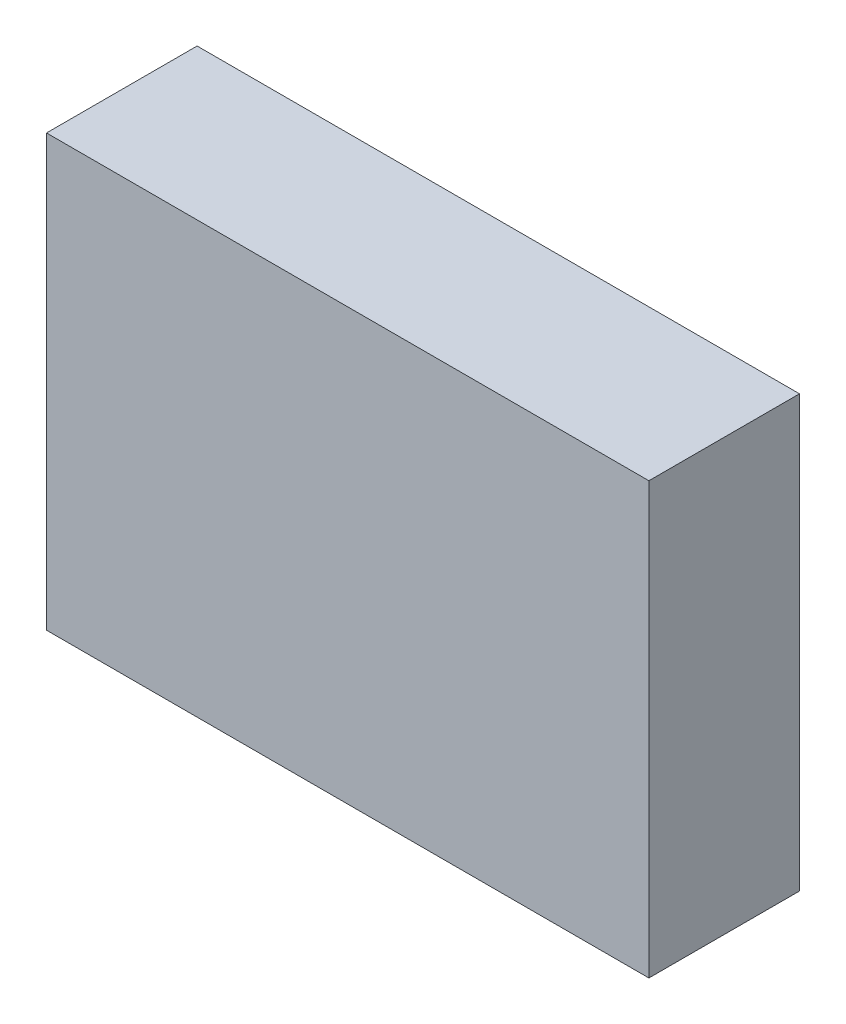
ISO-10303-21;
HEADER;
FILE_DESCRIPTION(('STEP AP214'),'2;1');
FILE_NAME('part.step','',(''),(''),'','','');
FILE_SCHEMA(('AUTOMOTIVE_DESIGN { 1 0 10303 214 1 1 1 1 }'));
ENDSEC;
DATA;
#1=APPLICATION_CONTEXT('core data for automotive mechanical design processes');
#2=APPLICATION_PROTOCOL_DEFINITION('international standard','automotive_design',2000,#1);
#3=PRODUCT_CONTEXT('',#1,'mechanical');
#4=PRODUCT('Part','Part','',(#3));
#5=PRODUCT_RELATED_PRODUCT_CATEGORY('part','',(#4));
#6=PRODUCT_DEFINITION_FORMATION('','',#4);
#7=PRODUCT_DEFINITION_CONTEXT('part definition',#1,'design');
#8=PRODUCT_DEFINITION('design','',#6,#7);
#9=PRODUCT_DEFINITION_SHAPE('','',#8);
#10=(LENGTH_UNIT() NAMED_UNIT(*) SI_UNIT(.MILLI.,.METRE.));
#11=(NAMED_UNIT(*) PLANE_ANGLE_UNIT() SI_UNIT($,.RADIAN.));
#12=(NAMED_UNIT(*) SI_UNIT($,.STERADIAN.) SOLID_ANGLE_UNIT());
#13=UNCERTAINTY_MEASURE_WITH_UNIT(LENGTH_MEASURE(1.E-05),#10,'distance_accuracy_value','');
#14=(GEOMETRIC_REPRESENTATION_CONTEXT(3) GLOBAL_UNCERTAINTY_ASSIGNED_CONTEXT((#13)) GLOBAL_UNIT_ASSIGNED_CONTEXT((#10,
#11,#12)) REPRESENTATION_CONTEXT('',''));
#15=CARTESIAN_POINT('',(0.,0.,0.));
#16=DIRECTION('',(0.,0.,1.));
#17=DIRECTION('',(1.,0.,0.));
#18=AXIS2_PLACEMENT_3D('',#15,#16,#17);
#19=CARTESIAN_POINT('',(-50.,792.500727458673,15.));
#20=DIRECTION('',(1.,0.,0.));
#21=DIRECTION('',(0.,0.,-1.));
#22=AXIS2_PLACEMENT_3D('',#19,#20,#21);
#23=PLANE('',#22);
#24=DIRECTION('',(0.,-1.,0.));
#25=VECTOR('',#24,1.);
#26=CARTESIAN_POINT('',(-50.,792.500727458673,0.));
#27=LINE('',#26,#25);
#28=CARTESIAN_POINT('',(-50.,792.500727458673,0.));
#29=VERTEX_POINT('',#28);
#30=CARTESIAN_POINT('',(-50.,749.606946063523,0.));
#31=VERTEX_POINT('',#30);
#32=EDGE_CURVE('E68',#29,#31,#27,.T.);
#33=ORIENTED_EDGE('',*,*,#32,.T.);
#34=DIRECTION('',(0.,0.,-1.));
#35=VECTOR('',#34,1.);
#36=CARTESIAN_POINT('',(-50.,749.606946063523,15.));
#37=LINE('',#36,#35);
#38=CARTESIAN_POINT('',(-50.,749.606946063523,15.));
#39=VERTEX_POINT('',#38);
#40=EDGE_CURVE('E11',#39,#31,#37,.T.);
#41=ORIENTED_EDGE('',*,*,#40,.F.);
#42=DIRECTION('',(0.,-1.,0.));
#43=VECTOR('',#42,1.);
#44=CARTESIAN_POINT('',(-50.,792.500727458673,15.));
#45=LINE('',#44,#43);
#46=CARTESIAN_POINT('',(-50.,792.500727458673,15.));
#47=VERTEX_POINT('',#46);
#48=EDGE_CURVE('E86',#47,#39,#45,.T.);
#49=ORIENTED_EDGE('',*,*,#48,.F.);
#50=DIRECTION('',(0.,0.,-1.));
#51=VECTOR('',#50,1.);
#52=CARTESIAN_POINT('',(-50.,792.500727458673,15.));
#53=LINE('',#52,#51);
#54=EDGE_CURVE('E80',#47,#29,#53,.T.);
#55=ORIENTED_EDGE('',*,*,#54,.T.);
#56=EDGE_LOOP('',(#33,#41,#49,#55));
#57=FACE_BOUND('',#56,.T.);
#58=ADVANCED_FACE('F24',(#57),#23,.F.);
#59=CARTESIAN_POINT('',(-50.,749.606946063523,15.));
#60=DIRECTION('',(0.,1.,0.));
#61=DIRECTION('',(0.,0.,1.));
#62=AXIS2_PLACEMENT_3D('',#59,#60,#61);
#63=PLANE('',#62);
#64=DIRECTION('',(1.,0.,0.));
#65=VECTOR('',#64,1.);
#66=CARTESIAN_POINT('',(-50.,749.606946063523,0.));
#67=LINE('',#66,#65);
#68=CARTESIAN_POINT('',(9.99999999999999,749.606946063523,0.));
#69=VERTEX_POINT('',#68);
#70=EDGE_CURVE('E64',#31,#69,#67,.T.);
#71=ORIENTED_EDGE('',*,*,#70,.T.);
#72=DIRECTION('',(0.,0.,-1.));
#73=VECTOR('',#72,1.);
#74=CARTESIAN_POINT('',(9.99999999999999,749.606946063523,15.));
#75=LINE('',#74,#73);
#76=CARTESIAN_POINT('',(9.99999999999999,749.606946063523,15.));
#77=VERTEX_POINT('',#76);
#78=EDGE_CURVE('E31',#77,#69,#75,.T.);
#79=ORIENTED_EDGE('',*,*,#78,.F.);
#80=DIRECTION('',(1.,0.,0.));
#81=VECTOR('',#80,1.);
#82=CARTESIAN_POINT('',(-50.,749.606946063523,15.));
#83=LINE('',#82,#81);
#84=EDGE_CURVE('E76',#39,#77,#83,.T.);
#85=ORIENTED_EDGE('',*,*,#84,.F.);
#86=ORIENTED_EDGE('',*,*,#40,.T.);
#87=EDGE_LOOP('',(#71,#79,#85,#86));
#88=FACE_BOUND('',#87,.T.);
#89=ADVANCED_FACE('F75',(#88),#63,.F.);
#90=CARTESIAN_POINT('',(9.99999999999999,792.500727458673,15.));
#91=DIRECTION('',(-1.,0.,0.));
#92=DIRECTION('',(0.,-1.,0.));
#93=AXIS2_PLACEMENT_3D('',#90,#91,#92);
#94=PLANE('',#93);
#95=DIRECTION('',(0.,1.,0.));
#96=VECTOR('',#95,1.);
#97=CARTESIAN_POINT('',(9.99999999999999,792.500727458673,0.));
#98=LINE('',#97,#96);
#99=CARTESIAN_POINT('',(9.99999999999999,792.500727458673,0.));
#100=VERTEX_POINT('',#99);
#101=EDGE_CURVE('E69',#69,#100,#98,.T.);
#102=ORIENTED_EDGE('',*,*,#101,.T.);
#103=DIRECTION('',(0.,0.,-1.));
#104=VECTOR('',#103,1.);
#105=CARTESIAN_POINT('',(9.99999999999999,792.500727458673,15.));
#106=LINE('',#105,#104);
#107=CARTESIAN_POINT('',(9.99999999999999,792.500727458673,15.));
#108=VERTEX_POINT('',#107);
#109=EDGE_CURVE('E92',#108,#100,#106,.T.);
#110=ORIENTED_EDGE('',*,*,#109,.F.);
#111=DIRECTION('',(0.,1.,0.));
#112=VECTOR('',#111,1.);
#113=CARTESIAN_POINT('',(9.99999999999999,792.500727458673,15.));
#114=LINE('',#113,#112);
#115=EDGE_CURVE('E43',#77,#108,#114,.T.);
#116=ORIENTED_EDGE('',*,*,#115,.F.);
#117=ORIENTED_EDGE('',*,*,#78,.T.);
#118=EDGE_LOOP('',(#102,#110,#116,#117));
#119=FACE_BOUND('',#118,.T.);
#120=ADVANCED_FACE('F95',(#119),#94,.F.);
#121=CARTESIAN_POINT('',(-50.,792.500727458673,15.));
#122=DIRECTION('',(0.,-1.,0.));
#123=DIRECTION('',(0.,0.,-1.));
#124=AXIS2_PLACEMENT_3D('',#121,#122,#123);
#125=PLANE('',#124);
#126=DIRECTION('',(-1.,0.,0.));
#127=VECTOR('',#126,1.);
#128=CARTESIAN_POINT('',(-50.,792.500727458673,0.));
#129=LINE('',#128,#127);
#130=EDGE_CURVE('E84',#100,#29,#129,.T.);
#131=ORIENTED_EDGE('',*,*,#130,.T.);
#132=ORIENTED_EDGE('',*,*,#54,.F.);
#133=DIRECTION('',(-1.,0.,0.));
#134=VECTOR('',#133,1.);
#135=CARTESIAN_POINT('',(-50.,792.500727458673,15.));
#136=LINE('',#135,#134);
#137=EDGE_CURVE('E38',#108,#47,#136,.T.);
#138=ORIENTED_EDGE('',*,*,#137,.F.);
#139=ORIENTED_EDGE('',*,*,#109,.T.);
#140=EDGE_LOOP('',(#131,#132,#138,#139));
#141=FACE_BOUND('',#140,.T.);
#142=ADVANCED_FACE('F97',(#141),#125,.F.);
#143=CARTESIAN_POINT('',(-50.,749.606946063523,15.));
#144=DIRECTION('',(0.,0.,1.));
#145=DIRECTION('',(1.,0.,0.));
#146=AXIS2_PLACEMENT_3D('',#143,#144,#145);
#147=PLANE('',#146);
#148=ORIENTED_EDGE('',*,*,#48,.T.);
#149=ORIENTED_EDGE('',*,*,#84,.T.);
#150=ORIENTED_EDGE('',*,*,#115,.T.);
#151=ORIENTED_EDGE('',*,*,#137,.T.);
#152=EDGE_LOOP('',(#148,#149,#150,#151));
#153=FACE_BOUND('',#152,.T.);
#154=ADVANCED_FACE('F98',(#153),#147,.T.);
#155=CARTESIAN_POINT('',(-50.,749.606946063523,0.));
#156=DIRECTION('',(0.,0.,1.));
#157=DIRECTION('',(1.,0.,0.));
#158=AXIS2_PLACEMENT_3D('',#155,#156,#157);
#159=PLANE('',#158);
#160=ORIENTED_EDGE('',*,*,#32,.F.);
#161=ORIENTED_EDGE('',*,*,#130,.F.);
#162=ORIENTED_EDGE('',*,*,#101,.F.);
#163=ORIENTED_EDGE('',*,*,#70,.F.);
#164=EDGE_LOOP('',(#160,#161,#162,#163));
#165=FACE_BOUND('',#164,.T.);
#166=ADVANCED_FACE('F65',(#165),#159,.F.);
#167=CLOSED_SHELL('',(#58,#89,#120,#142,#154,#166));
#168=MANIFOLD_SOLID_BREP('B2',#167);
#169=ADVANCED_BREP_SHAPE_REPRESENTATION('',(#18,#168),#14);
#170=SHAPE_DEFINITION_REPRESENTATION(#9,#169);
ENDSEC;
END-ISO-10303-21;
